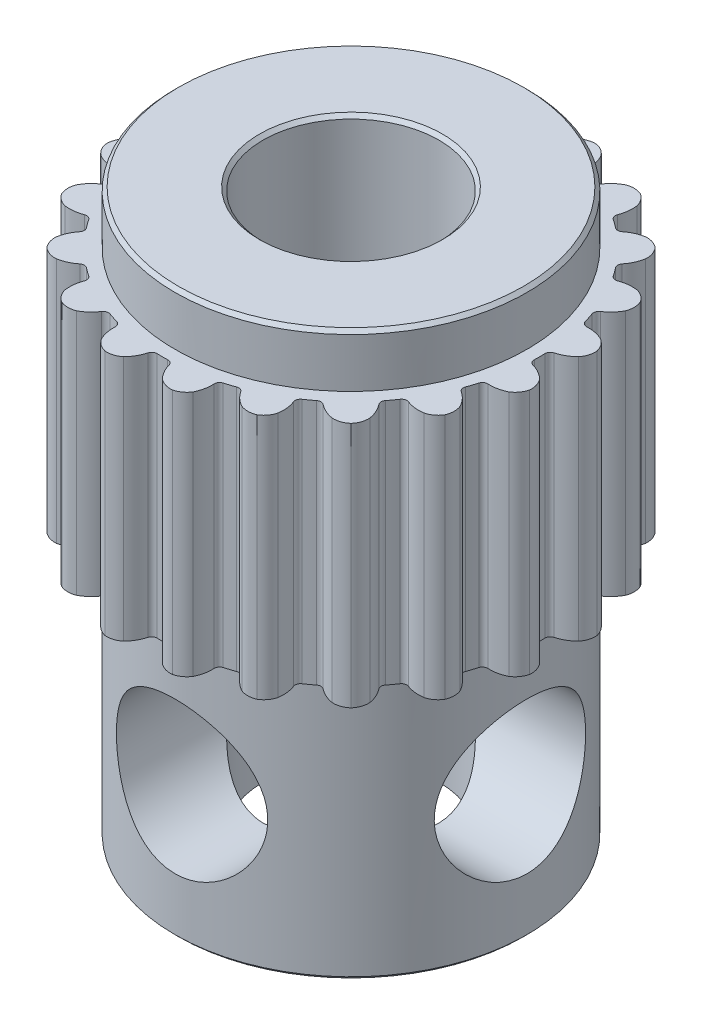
from build123d import *

# Parameters (mm, degrees)
BODYS_W                = 3.61
BODYS_H                = 7
GT2PROFILE_DEPTH       = 3.5
GT2_GROOVE_CP_COUNT    = 20
TOPWALLS_R             = 5
TOPWALLS_R_2           = 2.5
TOPWALL_DEPTH          = 1.5
BOTTOMWALL_START       = 7.5
BOTTOMWALLS_R          = 5
BOTTOMWALLS_R_2        = 2.5
BOTTOMWALL_DEPTH       = 7.5
CLEARANCE_HOLE1_REACH  = 18.71
CLEARANCE_HOLE1_BORE_R = 2.15
CIRPATTERN1_COUNT      = 2
CIRPATTERN1_ANGLE      = 90
INNERC_SIZE            = 0.1
OUTERC_SIZE            = 0.1


with BuildPart() as part:
    # BodyS → Body (revolve)
    with BuildSketch(Plane.XY, mode=Mode.PRIVATE) as body_sk:
        with Locations((4.305, 0)):
            Rectangle(BODYS_W, BODYS_H)
    revolve(body_sk.sketch.rotate(Axis((0, 3.5, 0), (0, -1, 0)), 90), axis=Axis((0, 3.5, 0), (0, -1, 0)))

    # GT2ProfileS → GT2Profile (cut, symmetric)
    with BuildSketch(Plane(origin=(0, 0, 0), x_dir=(1, 0, 0), z_dir=(0, 1, 0))):
        with BuildLine():
            ThreePointArc((0.299749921, -5.468781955), (0.244461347, -5.387479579), (0.150701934, -5.357881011))
            ThreePointArc((0.150701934, -5.357881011), (0, -5.36), (-0.150701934, -5.357881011))
            ThreePointArc((-0.150701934, -5.357881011), (-0.244461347, -5.387479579), (-0.299749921, -5.468781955))
            ThreePointArc((-0.299749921, -5.468781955), (-0.396626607, -5.703924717), (-0.549685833, -5.907025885))
            ThreePointArc((-0.549685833, -5.907025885), (-0.7593874, -6.016293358), (-0.995541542, -6.028349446))
            ThreePointArc((-0.995541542, -6.028349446), (0, -6.11), (0.995541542, -6.028349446))
            ThreePointArc((0.995541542, -6.028349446), (0.7593874, -6.016293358), (0.549685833, -5.907025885))
            ThreePointArc((0.549685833, -5.907025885), (0.396626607, -5.703924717), (0.299749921, -5.468781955))
        make_face()
    gt2profile = extrude(amount=GT2PROFILE_DEPTH, both=True, mode=Mode.SUBTRACT)

    # GT2 Groove CP: GT2Profile ×20 about axis
    gt2_groove_cp_axis = Axis((0, 0, 0), (0, 1, 0))
    for i in range(1, GT2_GROOVE_CP_COUNT):
        add(gt2profile.rotate(gt2_groove_cp_axis, i * 360 / GT2_GROOVE_CP_COUNT), mode=Mode.SUBTRACT)

    # TopWallS → TopWall (add)
    with BuildSketch(Plane(origin=(0, 3.5, 0), x_dir=(1, 0, 0), z_dir=(0, 1, 0))):
        with Locations(Location((0, 0, 0), (0, 0, 90))):
            Circle(TOPWALLS_R)
        with Locations(Location((0, 0, 0), (0, 0, 270))):
            Circle(TOPWALLS_R_2, mode=Mode.SUBTRACT)
    extrude(amount=TOPWALL_DEPTH)

    # BottomWallS → BottomWall (add)
    with BuildSketch(Plane(origin=(0, -3.5, 0), x_dir=(-1, 0, 0), z_dir=(0, -1, 0)).offset(BOTTOMWALL_START)):
        with Locations(Location((0, 0, 0), (0, 0, 90))):
            Circle(BOTTOMWALLS_R)
        with Locations(Location((0, 0, 0), (0, 0, 270))):
            Circle(BOTTOMWALLS_R_2, mode=Mode.SUBTRACT)
    extrude(amount=-BOTTOMWALL_DEPTH)

    # Clearance Hole1 bore → Clearance Hole1 (cut, up to next)
    with BuildSketch(Plane.XY.offset(5), mode=Mode.PRIVATE) as clearance_hole1_sk1:
        with Locations((0, -7.25)):
            Circle(CLEARANCE_HOLE1_BORE_R)
    clearance_hole1_tool1 = extrude(clearance_hole1_sk1.sketch, amount=-CLEARANCE_HOLE1_REACH, mode=Mode.PRIVATE) & part.part
    clearance_hole1 = clearance_hole1_tool1.solids().sort_by_distance((0, -7.25, 5))[0]
    add(clearance_hole1, mode=Mode.SUBTRACT)

    # CirPattern1: Clearance Hole1 ×2 about axis
    cirpattern1_axis = Axis((0, -11, 0), (0, 1, 0))
    for i in range(1, CIRPATTERN1_COUNT):
        add(clearance_hole1.rotate(cirpattern1_axis, i * CIRPATTERN1_ANGLE / (CIRPATTERN1_COUNT - 1)), mode=Mode.SUBTRACT)

    # InnerC
    innerc_edges = [part.edges().sort_by_distance(p)[0] for p in [
        (0, 5, -2.5),
        (0, -11, -2.5),
    ]]
    chamfer(innerc_edges, length=INNERC_SIZE)

    # OuterC
    outerc_edges = [part.edges().sort_by_distance(p)[0] for p in [
        (0, 5, 5),
        (0, -11, 5),
    ]]
    chamfer(outerc_edges, length=OUTERC_SIZE)


solid = part.part
